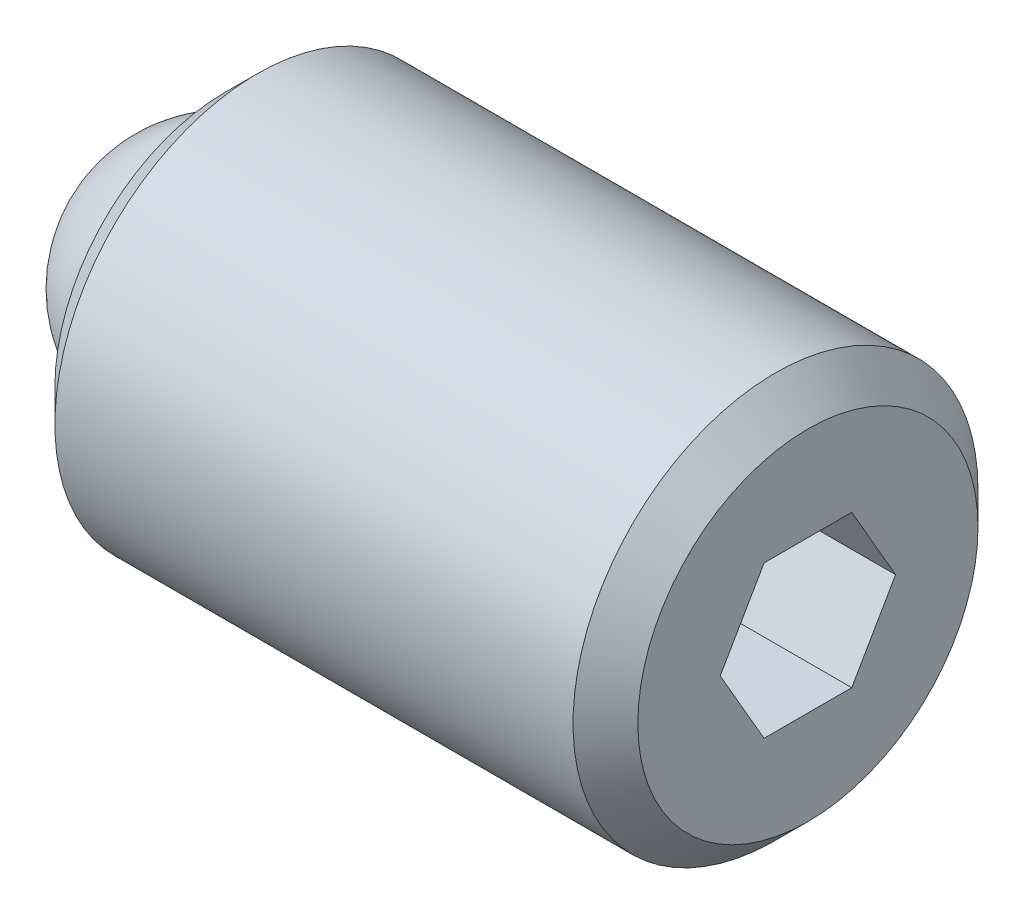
from build123d import *

# Parameters (mm, degrees)
SKETCH2_R           = 3.175
BOSS_EXTRUDE1_DEPTH = 9.140825
CHAMFER1_SIZE       = 0.508
CHAMFER2_SIZE       = 0.508
CUT_EXTRUDE2_DEPTH  = 2.286
SKETCH3_R           = 1.9812
CUT_EXTRUDE3_DEPTH  = 1.984375


with BuildPart() as part:
    # Sketch2 → Boss-Extrude1 (new body)
    with BuildSketch(Plane(origin=(0, 0, 0), x_dir=(0, 0, -1), z_dir=(1, 0, 0))):
        Circle(SKETCH2_R)
    extrude(amount=BOSS_EXTRUDE1_DEPTH)

    # Chamfer1
    chamfer1_edges = [part.edges().sort_by_distance(p)[0] for p in [
        (0, 0, 3.175),
    ]]
    chamfer(chamfer1_edges, length=CHAMFER1_SIZE)

    # Chamfer2
    chamfer2_edges = [part.edges().sort_by_distance(p)[0] for p in [
        (9.140825, 0, 3.175),
    ]]
    chamfer(chamfer2_edges, length=CHAMFER2_SIZE)

    # Sketch4 → Cut-Extrude2 (cut)
    with BuildSketch(Plane(origin=(9.140825, 0, 0), x_dir=(0, 0, -1), z_dir=(1, 0, 0))):
        Polygon((1.374815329, 0), (0.687407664, 1.190625), (-0.687407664, 1.190625), (-1.374815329, 0), (-0.687407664, -1.190625), (0.687407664, -1.190625), align=None)
    extrude(amount=-CUT_EXTRUDE2_DEPTH, mode=Mode.SUBTRACT)

    # Sketch3 → Cut-Extrude3 (cut)
    with BuildSketch(Plane.ZY):
        Circle(SKETCH3_R)
    extrude(amount=-CUT_EXTRUDE3_DEPTH, mode=Mode.SUBTRACT)


with BuildPart() as body_2:
    # Sketch5 → Revolve1 (revolve)
    with BuildSketch(Plane.ZY):
        with BuildLine():
            Line((0, 0), (0, -1.984375))
            ThreePointArc((0, -1.984375), (-1.984375, 0), (0, 1.984375))
            Line((0, 1.984375), (0, 0))
        make_face()
    revolve(axis=Axis((0, 0, 0), (0, 1, 0)))


solid = Compound([part.part, body_2.part])
